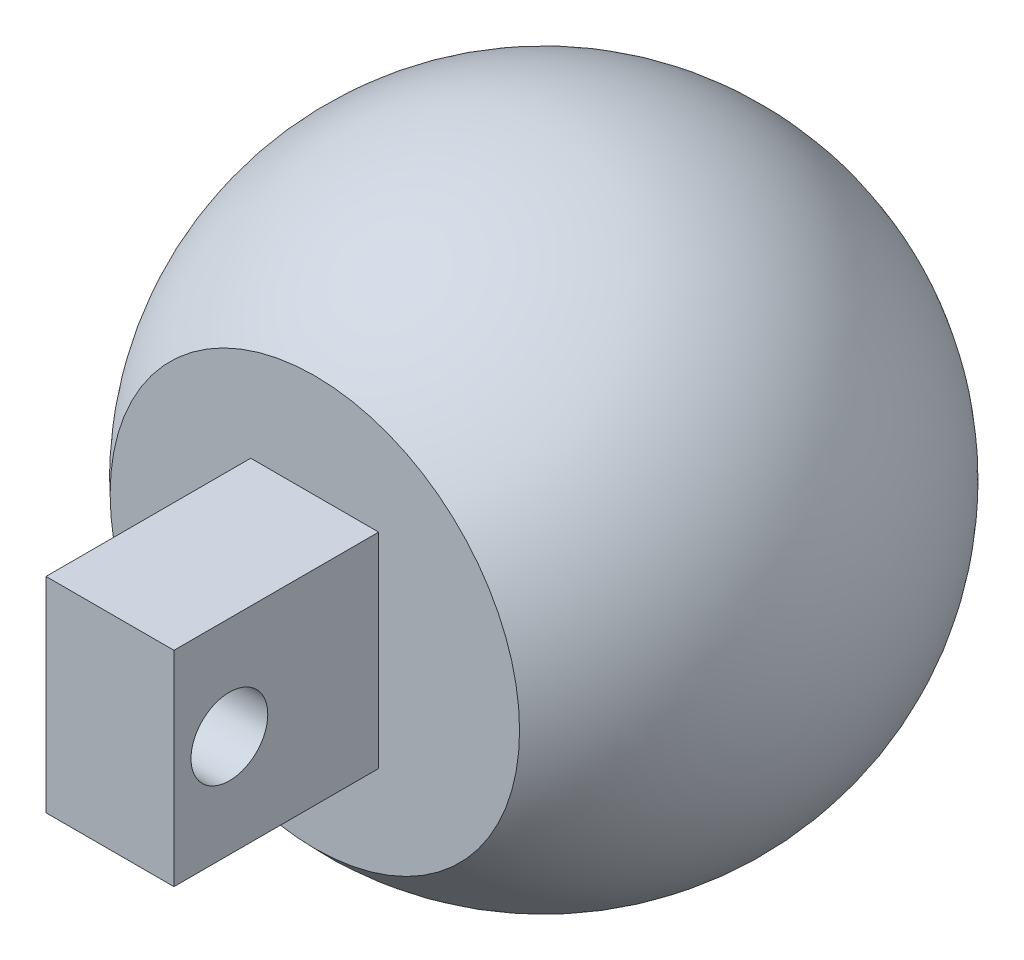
ISO-10303-21;
HEADER;
FILE_DESCRIPTION(('STEP AP214'),'2;1');
FILE_NAME('part.step','',(''),(''),'','','');
FILE_SCHEMA(('AUTOMOTIVE_DESIGN { 1 0 10303 214 1 1 1 1 }'));
ENDSEC;
DATA;
#1=APPLICATION_CONTEXT('core data for automotive mechanical design processes');
#2=APPLICATION_PROTOCOL_DEFINITION('international standard','automotive_design',2000,#1);
#3=PRODUCT_CONTEXT('',#1,'mechanical');
#4=PRODUCT('Part','Part','',(#3));
#5=PRODUCT_RELATED_PRODUCT_CATEGORY('part','',(#4));
#6=PRODUCT_DEFINITION_FORMATION('','',#4);
#7=PRODUCT_DEFINITION_CONTEXT('part definition',#1,'design');
#8=PRODUCT_DEFINITION('design','',#6,#7);
#9=PRODUCT_DEFINITION_SHAPE('','',#8);
#10=(LENGTH_UNIT() NAMED_UNIT(*) SI_UNIT(.MILLI.,.METRE.));
#11=(NAMED_UNIT(*) PLANE_ANGLE_UNIT() SI_UNIT($,.RADIAN.));
#12=(NAMED_UNIT(*) SI_UNIT($,.STERADIAN.) SOLID_ANGLE_UNIT());
#13=UNCERTAINTY_MEASURE_WITH_UNIT(LENGTH_MEASURE(1.E-05),#10,'distance_accuracy_value','');
#14=(GEOMETRIC_REPRESENTATION_CONTEXT(3) GLOBAL_UNCERTAINTY_ASSIGNED_CONTEXT((#13)) GLOBAL_UNIT_ASSIGNED_CONTEXT((#10,
#11,#12)) REPRESENTATION_CONTEXT('',''));
#15=CARTESIAN_POINT('',(0.,0.,0.));
#16=DIRECTION('',(0.,0.,1.));
#17=DIRECTION('',(1.,0.,0.));
#18=AXIS2_PLACEMENT_3D('',#15,#16,#17);
#19=CARTESIAN_POINT('',(-46.1013675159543,0.,-20.6377812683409));
#20=DIRECTION('',(0.,0.,-1.));
#21=DIRECTION('',(-1.,0.,0.));
#22=AXIS2_PLACEMENT_3D('',#19,#20,#21);
#23=PLANE('',#22);
#24=CARTESIAN_POINT('',(-62.1013675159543,0.,-20.6377812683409));
#25=DIRECTION('',(0.,0.,-1.));
#26=DIRECTION('',(-1.,0.,0.));
#27=AXIS2_PLACEMENT_3D('',#24,#25,#26);
#28=CIRCLE('',#27,16.);
#29=CARTESIAN_POINT('',(-78.1013675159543,0.,-20.6377812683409));
#30=VERTEX_POINT('',#29);
#31=EDGE_CURVE('E11',#30,#30,#28,.T.);
#32=ORIENTED_EDGE('',*,*,#31,.F.);
#33=EDGE_LOOP('',(#32));
#34=FACE_BOUND('',#33,.T.);
#35=DIRECTION('',(0.,-1.,0.));
#36=VECTOR('',#35,1.);
#37=CARTESIAN_POINT('',(-67.1133210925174,-8.08339392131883,-20.6377812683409));
#38=LINE('',#37,#36);
#39=CARTESIAN_POINT('',(-67.1133210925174,7.91660607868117,-20.6377812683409));
#40=VERTEX_POINT('',#39);
#41=CARTESIAN_POINT('',(-67.1133210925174,-8.08339392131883,-20.6377812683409));
#42=VERTEX_POINT('',#41);
#43=EDGE_CURVE('E91',#40,#42,#38,.T.);
#44=ORIENTED_EDGE('',*,*,#43,.F.);
#45=DIRECTION('',(-1.,0.,0.));
#46=VECTOR('',#45,1.);
#47=CARTESIAN_POINT('',(-57.1133210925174,7.91660607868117,-20.6377812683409));
#48=LINE('',#47,#46);
#49=CARTESIAN_POINT('',(-57.1133210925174,7.91660607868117,-20.6377812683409));
#50=VERTEX_POINT('',#49);
#51=EDGE_CURVE('E88',#50,#40,#48,.T.);
#52=ORIENTED_EDGE('',*,*,#51,.F.);
#53=DIRECTION('',(0.,1.,0.));
#54=VECTOR('',#53,1.);
#55=CARTESIAN_POINT('',(-57.1133210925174,-8.08339392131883,-20.6377812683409));
#56=LINE('',#55,#54);
#57=CARTESIAN_POINT('',(-57.1133210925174,-8.08339392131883,-20.6377812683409));
#58=VERTEX_POINT('',#57);
#59=EDGE_CURVE('E51',#58,#50,#56,.T.);
#60=ORIENTED_EDGE('',*,*,#59,.F.);
#61=DIRECTION('',(1.,0.,0.));
#62=VECTOR('',#61,1.);
#63=CARTESIAN_POINT('',(-57.1133210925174,-8.08339392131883,-20.6377812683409));
#64=LINE('',#63,#62);
#65=EDGE_CURVE('E46',#42,#58,#64,.T.);
#66=ORIENTED_EDGE('',*,*,#65,.F.);
#67=EDGE_LOOP('',(#44,#52,#60,#66));
#68=FACE_BOUND('',#67,.T.);
#69=ADVANCED_FACE('F31',(#34,#68),#23,.F.);
#70=CARTESIAN_POINT('',(-62.1013675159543,0.,-38.5263250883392));
#71=DIRECTION('',(0.,0.,-1.));
#72=DIRECTION('',(1.,0.,0.));
#73=AXIS2_PLACEMENT_3D('',#70,#71,#72);
#74=SPHERICAL_SURFACE('',#73,24.);
#75=ORIENTED_EDGE('',*,*,#31,.T.);
#76=EDGE_LOOP('',(#75));
#77=FACE_BOUND('',#76,.T.);
#78=ADVANCED_FACE('F33',(#77),#74,.T.);
#79=CARTESIAN_POINT('',(-67.1133210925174,-8.08339392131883,-4.63778126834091));
#80=DIRECTION('',(1.,0.,0.));
#81=DIRECTION('',(0.,0.,-1.));
#82=AXIS2_PLACEMENT_3D('',#79,#80,#81);
#83=PLANE('',#82);
#84=CARTESIAN_POINT('',(-67.1133210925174,-0.0833939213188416,-8.97111460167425));
#85=DIRECTION('',(1.,0.,0.));
#86=DIRECTION('',(0.,0.,-1.));
#87=AXIS2_PLACEMENT_3D('',#84,#85,#86);
#88=CIRCLE('',#87,2.99999999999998);
#89=CARTESIAN_POINT('',(-67.1133210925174,-0.0833939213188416,-11.9711146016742));
#90=VERTEX_POINT('',#89);
#91=EDGE_CURVE('E104',#90,#90,#88,.T.);
#92=ORIENTED_EDGE('',*,*,#91,.T.);
#93=EDGE_LOOP('',(#92));
#94=FACE_BOUND('',#93,.T.);
#95=ORIENTED_EDGE('',*,*,#43,.T.);
#96=DIRECTION('',(0.,0.,-1.));
#97=VECTOR('',#96,1.);
#98=CARTESIAN_POINT('',(-67.1133210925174,-8.08339392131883,-4.63778126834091));
#99=LINE('',#98,#97);
#100=CARTESIAN_POINT('',(-67.1133210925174,-8.08339392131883,-4.63778126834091));
#101=VERTEX_POINT('',#100);
#102=EDGE_CURVE('E39',#101,#42,#99,.T.);
#103=ORIENTED_EDGE('',*,*,#102,.F.);
#104=DIRECTION('',(0.,-1.,0.));
#105=VECTOR('',#104,1.);
#106=CARTESIAN_POINT('',(-67.1133210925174,-8.08339392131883,-4.63778126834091));
#107=LINE('',#106,#105);
#108=CARTESIAN_POINT('',(-67.1133210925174,7.91660607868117,-4.63778126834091));
#109=VERTEX_POINT('',#108);
#110=EDGE_CURVE('E79',#109,#101,#107,.T.);
#111=ORIENTED_EDGE('',*,*,#110,.F.);
#112=DIRECTION('',(0.,0.,-1.));
#113=VECTOR('',#112,1.);
#114=CARTESIAN_POINT('',(-67.1133210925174,7.91660607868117,-4.63778126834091));
#115=LINE('',#114,#113);
#116=EDGE_CURVE('E97',#109,#40,#115,.T.);
#117=ORIENTED_EDGE('',*,*,#116,.T.);
#118=EDGE_LOOP('',(#95,#103,#111,#117));
#119=FACE_BOUND('',#118,.T.);
#120=ADVANCED_FACE('F90',(#94,#119),#83,.F.);
#121=CARTESIAN_POINT('',(-57.1133210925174,-8.08339392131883,-4.63778126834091));
#122=DIRECTION('',(0.,1.,0.));
#123=DIRECTION('',(-1.,0.,0.));
#124=AXIS2_PLACEMENT_3D('',#121,#122,#123);
#125=PLANE('',#124);
#126=ORIENTED_EDGE('',*,*,#65,.T.);
#127=DIRECTION('',(0.,0.,-1.));
#128=VECTOR('',#127,1.);
#129=CARTESIAN_POINT('',(-57.1133210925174,-8.08339392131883,-4.63778126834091));
#130=LINE('',#129,#128);
#131=CARTESIAN_POINT('',(-57.1133210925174,-8.08339392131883,-4.63778126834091));
#132=VERTEX_POINT('',#131);
#133=EDGE_CURVE('E75',#132,#58,#130,.T.);
#134=ORIENTED_EDGE('',*,*,#133,.F.);
#135=DIRECTION('',(1.,0.,0.));
#136=VECTOR('',#135,1.);
#137=CARTESIAN_POINT('',(-57.1133210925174,-8.08339392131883,-4.63778126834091));
#138=LINE('',#137,#136);
#139=EDGE_CURVE('E69',#101,#132,#138,.T.);
#140=ORIENTED_EDGE('',*,*,#139,.F.);
#141=ORIENTED_EDGE('',*,*,#102,.T.);
#142=EDGE_LOOP('',(#126,#134,#140,#141));
#143=FACE_BOUND('',#142,.T.);
#144=ADVANCED_FACE('F71',(#143),#125,.F.);
#145=CARTESIAN_POINT('',(-57.1133210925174,-8.08339392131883,-4.63778126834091));
#146=DIRECTION('',(-1.,0.,0.));
#147=DIRECTION('',(0.,0.,1.));
#148=AXIS2_PLACEMENT_3D('',#145,#146,#147);
#149=PLANE('',#148);
#150=CARTESIAN_POINT('',(-57.1133210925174,-0.0833939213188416,-8.97111460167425));
#151=DIRECTION('',(1.,0.,0.));
#152=DIRECTION('',(0.,0.,-1.));
#153=AXIS2_PLACEMENT_3D('',#150,#151,#152);
#154=CIRCLE('',#153,2.99999999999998);
#155=CARTESIAN_POINT('',(-57.1133210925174,-0.0833939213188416,-11.9711146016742));
#156=VERTEX_POINT('',#155);
#157=EDGE_CURVE('E109',#156,#156,#154,.T.);
#158=ORIENTED_EDGE('',*,*,#157,.F.);
#159=EDGE_LOOP('',(#158));
#160=FACE_BOUND('',#159,.T.);
#161=ORIENTED_EDGE('',*,*,#59,.T.);
#162=DIRECTION('',(0.,0.,-1.));
#163=VECTOR('',#162,1.);
#164=CARTESIAN_POINT('',(-57.1133210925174,7.91660607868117,-4.63778126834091));
#165=LINE('',#164,#163);
#166=CARTESIAN_POINT('',(-57.1133210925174,7.91660607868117,-4.63778126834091));
#167=VERTEX_POINT('',#166);
#168=EDGE_CURVE('E92',#167,#50,#165,.T.);
#169=ORIENTED_EDGE('',*,*,#168,.F.);
#170=DIRECTION('',(0.,1.,0.));
#171=VECTOR('',#170,1.);
#172=CARTESIAN_POINT('',(-57.1133210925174,-8.08339392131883,-4.63778126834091));
#173=LINE('',#172,#171);
#174=EDGE_CURVE('E78',#132,#167,#173,.T.);
#175=ORIENTED_EDGE('',*,*,#174,.F.);
#176=ORIENTED_EDGE('',*,*,#133,.T.);
#177=EDGE_LOOP('',(#161,#169,#175,#176));
#178=FACE_BOUND('',#177,.T.);
#179=ADVANCED_FACE('F116',(#160,#178),#149,.F.);
#180=CARTESIAN_POINT('',(-57.1133210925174,7.91660607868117,-4.63778126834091));
#181=DIRECTION('',(0.,-1.,0.));
#182=DIRECTION('',(0.,0.,-1.));
#183=AXIS2_PLACEMENT_3D('',#180,#181,#182);
#184=PLANE('',#183);
#185=ORIENTED_EDGE('',*,*,#51,.T.);
#186=ORIENTED_EDGE('',*,*,#116,.F.);
#187=DIRECTION('',(-1.,0.,0.));
#188=VECTOR('',#187,1.);
#189=CARTESIAN_POINT('',(-57.1133210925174,7.91660607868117,-4.63778126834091));
#190=LINE('',#189,#188);
#191=EDGE_CURVE('E84',#167,#109,#190,.T.);
#192=ORIENTED_EDGE('',*,*,#191,.F.);
#193=ORIENTED_EDGE('',*,*,#168,.T.);
#194=EDGE_LOOP('',(#185,#186,#192,#193));
#195=FACE_BOUND('',#194,.T.);
#196=ADVANCED_FACE('F119',(#195),#184,.F.);
#197=CARTESIAN_POINT('',(-67.1133210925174,7.91660607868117,-4.63778126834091));
#198=DIRECTION('',(0.,0.,1.));
#199=DIRECTION('',(1.,0.,0.));
#200=AXIS2_PLACEMENT_3D('',#197,#198,#199);
#201=PLANE('',#200);
#202=ORIENTED_EDGE('',*,*,#110,.T.);
#203=ORIENTED_EDGE('',*,*,#139,.T.);
#204=ORIENTED_EDGE('',*,*,#174,.T.);
#205=ORIENTED_EDGE('',*,*,#191,.T.);
#206=EDGE_LOOP('',(#202,#203,#204,#205));
#207=FACE_BOUND('',#206,.T.);
#208=ADVANCED_FACE('F82',(#207),#201,.T.);
#209=CARTESIAN_POINT('',(-86.1013675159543,-0.0833939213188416,-8.97111460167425));
#210=DIRECTION('',(1.,0.,0.));
#211=DIRECTION('',(0.,0.,-1.));
#212=AXIS2_PLACEMENT_3D('',#209,#210,#211);
#213=CYLINDRICAL_SURFACE('',#212,2.99999999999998);
#214=ORIENTED_EDGE('',*,*,#157,.T.);
#215=EDGE_LOOP('',(#214));
#216=FACE_BOUND('',#215,.T.);
#217=ORIENTED_EDGE('',*,*,#91,.F.);
#218=EDGE_LOOP('',(#217));
#219=FACE_BOUND('',#218,.T.);
#220=ADVANCED_FACE('F113',(#216,#219),#213,.F.);
#221=CLOSED_SHELL('',(#69,#78,#120,#144,#179,#196,#208,#220));
#222=MANIFOLD_SOLID_BREP('B2',#221);
#223=ADVANCED_BREP_SHAPE_REPRESENTATION('',(#18,#222),#14);
#224=SHAPE_DEFINITION_REPRESENTATION(#9,#223);
ENDSEC;
END-ISO-10303-21;
